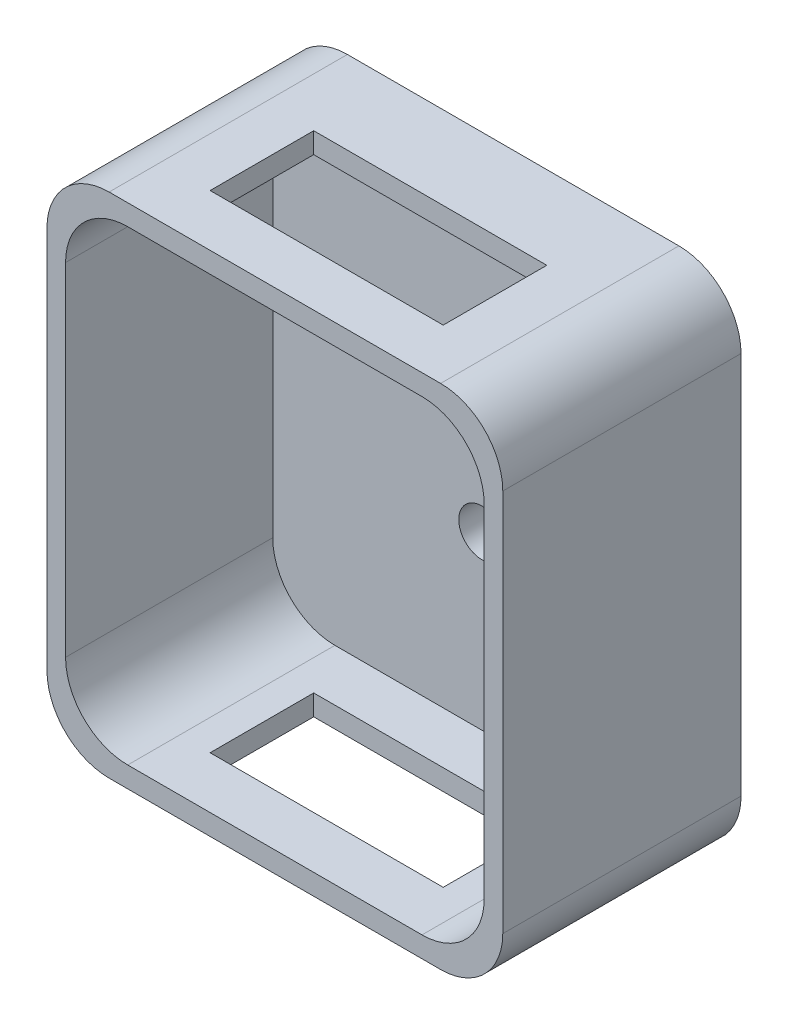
ISO-10303-21;
HEADER;
FILE_DESCRIPTION(('STEP AP214'),'2;1');
FILE_NAME('part.step','',(''),(''),'','','');
FILE_SCHEMA(('AUTOMOTIVE_DESIGN { 1 0 10303 214 1 1 1 1 }'));
ENDSEC;
DATA;
#1=APPLICATION_CONTEXT('core data for automotive mechanical design processes');
#2=APPLICATION_PROTOCOL_DEFINITION('international standard','automotive_design',2000,#1);
#3=PRODUCT_CONTEXT('',#1,'mechanical');
#4=PRODUCT('Part','Part','',(#3));
#5=PRODUCT_RELATED_PRODUCT_CATEGORY('part','',(#4));
#6=PRODUCT_DEFINITION_FORMATION('','',#4);
#7=PRODUCT_DEFINITION_CONTEXT('part definition',#1,'design');
#8=PRODUCT_DEFINITION('design','',#6,#7);
#9=PRODUCT_DEFINITION_SHAPE('','',#8);
#10=(LENGTH_UNIT() NAMED_UNIT(*) SI_UNIT(.MILLI.,.METRE.));
#11=(NAMED_UNIT(*) PLANE_ANGLE_UNIT() SI_UNIT($,.RADIAN.));
#12=(NAMED_UNIT(*) SI_UNIT($,.STERADIAN.) SOLID_ANGLE_UNIT());
#13=UNCERTAINTY_MEASURE_WITH_UNIT(LENGTH_MEASURE(1.E-05),#10,'distance_accuracy_value','');
#14=(GEOMETRIC_REPRESENTATION_CONTEXT(3) GLOBAL_UNCERTAINTY_ASSIGNED_CONTEXT((#13)) GLOBAL_UNIT_ASSIGNED_CONTEXT((#10,
#11,#12)) REPRESENTATION_CONTEXT('',''));
#15=CARTESIAN_POINT('',(0.,0.,0.));
#16=DIRECTION('',(0.,0.,1.));
#17=DIRECTION('',(1.,0.,0.));
#18=AXIS2_PLACEMENT_3D('',#15,#16,#17);
#19=CARTESIAN_POINT('',(-16.,-18.5000000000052,3.));
#20=DIRECTION('',(0.,0.,1.));
#21=DIRECTION('',(1.,0.,0.));
#22=AXIS2_PLACEMENT_3D('',#19,#20,#21);
#23=PLANE('',#22);
#24=CARTESIAN_POINT('',(-14.2040816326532,-16.5000000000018,3.));
#25=DIRECTION('',(0.,0.,1.));
#26=DIRECTION('',(1.,0.,0.));
#27=AXIS2_PLACEMENT_3D('',#24,#25,#26);
#28=CIRCLE('',#27,6.);
#29=CARTESIAN_POINT('',(-20.2040816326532,-16.5000000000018,3.));
#30=VERTEX_POINT('',#29);
#31=CARTESIAN_POINT('',(-14.2040816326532,-22.5000000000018,3.));
#32=VERTEX_POINT('',#31);
#33=EDGE_CURVE('E277',#30,#32,#28,.T.);
#34=ORIENTED_EDGE('',*,*,#33,.T.);
#35=DIRECTION('',(1.,0.,0.));
#36=VECTOR('',#35,1.);
#37=CARTESIAN_POINT('',(-14.2040816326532,-22.5000000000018,3.));
#38=LINE('',#37,#36);
#39=CARTESIAN_POINT('',(14.2040816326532,-22.5000000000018,3.));
#40=VERTEX_POINT('',#39);
#41=EDGE_CURVE('E307',#32,#40,#38,.T.);
#42=ORIENTED_EDGE('',*,*,#41,.T.);
#43=CARTESIAN_POINT('',(14.2040816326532,-16.5000000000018,3.));
#44=DIRECTION('',(0.,0.,1.));
#45=DIRECTION('',(1.,0.,0.));
#46=AXIS2_PLACEMENT_3D('',#43,#44,#45);
#47=CIRCLE('',#46,6.);
#48=CARTESIAN_POINT('',(20.2040816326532,-16.5000000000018,3.));
#49=VERTEX_POINT('',#48);
#50=EDGE_CURVE('E310',#40,#49,#47,.T.);
#51=ORIENTED_EDGE('',*,*,#50,.T.);
#52=DIRECTION('',(0.,1.,0.));
#53=VECTOR('',#52,1.);
#54=CARTESIAN_POINT('',(20.2040816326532,16.5000000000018,3.));
#55=LINE('',#54,#53);
#56=CARTESIAN_POINT('',(20.2040816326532,16.5000000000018,3.));
#57=VERTEX_POINT('',#56);
#58=EDGE_CURVE('E313',#49,#57,#55,.T.);
#59=ORIENTED_EDGE('',*,*,#58,.T.);
#60=CARTESIAN_POINT('',(14.2040816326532,16.5000000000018,3.));
#61=DIRECTION('',(0.,0.,1.));
#62=DIRECTION('',(1.,0.,0.));
#63=AXIS2_PLACEMENT_3D('',#60,#61,#62);
#64=CIRCLE('',#63,6.);
#65=CARTESIAN_POINT('',(14.2040816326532,22.5000000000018,3.));
#66=VERTEX_POINT('',#65);
#67=EDGE_CURVE('E316',#57,#66,#64,.T.);
#68=ORIENTED_EDGE('',*,*,#67,.T.);
#69=DIRECTION('',(-1.,0.,0.));
#70=VECTOR('',#69,1.);
#71=CARTESIAN_POINT('',(-14.2040816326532,22.5000000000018,3.));
#72=LINE('',#71,#70);
#73=CARTESIAN_POINT('',(-14.2040816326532,22.5000000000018,3.));
#74=VERTEX_POINT('',#73);
#75=EDGE_CURVE('E319',#66,#74,#72,.T.);
#76=ORIENTED_EDGE('',*,*,#75,.T.);
#77=CARTESIAN_POINT('',(-14.2040816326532,16.5000000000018,3.));
#78=DIRECTION('',(0.,0.,1.));
#79=DIRECTION('',(-1.,0.,0.));
#80=AXIS2_PLACEMENT_3D('',#77,#78,#79);
#81=CIRCLE('',#80,6.);
#82=CARTESIAN_POINT('',(-20.2040816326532,16.5000000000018,3.));
#83=VERTEX_POINT('',#82);
#84=EDGE_CURVE('E322',#74,#83,#81,.T.);
#85=ORIENTED_EDGE('',*,*,#84,.T.);
#86=DIRECTION('',(0.,-1.,0.));
#87=VECTOR('',#86,1.);
#88=CARTESIAN_POINT('',(-20.2040816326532,16.5000000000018,3.));
#89=LINE('',#88,#87);
#90=EDGE_CURVE('E282',#83,#30,#89,.T.);
#91=ORIENTED_EDGE('',*,*,#90,.T.);
#92=EDGE_LOOP('',(#34,#42,#51,#59,#68,#76,#85,#91));
#93=FACE_BOUND('',#92,.T.);
#94=CARTESIAN_POINT('',(0.,6.,3.));
#95=DIRECTION('',(0.,0.,1.));
#96=DIRECTION('',(1.,0.,0.));
#97=AXIS2_PLACEMENT_3D('',#94,#95,#96);
#98=CIRCLE('',#97,2.25);
#99=CARTESIAN_POINT('',(2.25,6.,3.));
#100=VERTEX_POINT('',#99);
#101=EDGE_CURVE('E399',#100,#100,#98,.T.);
#102=ORIENTED_EDGE('',*,*,#101,.F.);
#103=EDGE_LOOP('',(#102));
#104=FACE_BOUND('',#103,.T.);
#105=CARTESIAN_POINT('',(13.4,12.275,3.));
#106=DIRECTION('',(0.,0.,1.));
#107=DIRECTION('',(1.,0.,0.));
#108=AXIS2_PLACEMENT_3D('',#105,#106,#107);
#109=CIRCLE('',#108,1.5);
#110=CARTESIAN_POINT('',(14.9,12.275,3.));
#111=VERTEX_POINT('',#110);
#112=EDGE_CURVE('E415',#111,#111,#109,.T.);
#113=ORIENTED_EDGE('',*,*,#112,.F.);
#114=EDGE_LOOP('',(#113));
#115=FACE_BOUND('',#114,.T.);
#116=CARTESIAN_POINT('',(13.4,-8.225,3.));
#117=DIRECTION('',(0.,0.,1.));
#118=DIRECTION('',(1.,0.,0.));
#119=AXIS2_PLACEMENT_3D('',#116,#117,#118);
#120=CIRCLE('',#119,1.5);
#121=CARTESIAN_POINT('',(14.9,-8.225,3.));
#122=VERTEX_POINT('',#121);
#123=EDGE_CURVE('E407',#122,#122,#120,.T.);
#124=ORIENTED_EDGE('',*,*,#123,.F.);
#125=EDGE_LOOP('',(#124));
#126=FACE_BOUND('',#125,.T.);
#127=CARTESIAN_POINT('',(0.,-6.,3.));
#128=DIRECTION('',(0.,0.,1.));
#129=DIRECTION('',(1.,0.,0.));
#130=AXIS2_PLACEMENT_3D('',#127,#128,#129);
#131=CIRCLE('',#130,2.25);
#132=CARTESIAN_POINT('',(2.25,-6.,3.));
#133=VERTEX_POINT('',#132);
#134=EDGE_CURVE('E391',#133,#133,#131,.T.);
#135=ORIENTED_EDGE('',*,*,#134,.F.);
#136=EDGE_LOOP('',(#135));
#137=FACE_BOUND('',#136,.T.);
#138=ADVANCED_FACE('F45',(#93,#104,#115,#126,#137),#23,.T.);
#139=CARTESIAN_POINT('',(-16.,-18.5000000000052,0.));
#140=DIRECTION('',(0.,0.,1.));
#141=DIRECTION('',(1.,0.,0.));
#142=AXIS2_PLACEMENT_3D('',#139,#140,#141);
#143=PLANE('',#142);
#144=CARTESIAN_POINT('',(-16.,-18.5000000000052,0.));
#145=DIRECTION('',(0.,0.,1.));
#146=DIRECTION('',(1.,0.,0.));
#147=AXIS2_PLACEMENT_3D('',#144,#145,#146);
#148=CIRCLE('',#147,6.);
#149=CARTESIAN_POINT('',(-22.,-18.5000000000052,0.));
#150=VERTEX_POINT('',#149);
#151=CARTESIAN_POINT('',(-16.,-24.5000000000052,0.));
#152=VERTEX_POINT('',#151);
#153=EDGE_CURVE('E419',#150,#152,#148,.T.);
#154=ORIENTED_EDGE('',*,*,#153,.F.);
#155=DIRECTION('',(0.,-1.,0.));
#156=VECTOR('',#155,1.);
#157=CARTESIAN_POINT('',(-22.,-18.5000000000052,0.));
#158=LINE('',#157,#156);
#159=CARTESIAN_POINT('',(-22.,18.5000000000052,0.));
#160=VERTEX_POINT('',#159);
#161=EDGE_CURVE('E444',#160,#150,#158,.T.);
#162=ORIENTED_EDGE('',*,*,#161,.F.);
#163=CARTESIAN_POINT('',(-16.,18.5000000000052,0.));
#164=DIRECTION('',(0.,0.,1.));
#165=DIRECTION('',(1.,0.,0.));
#166=AXIS2_PLACEMENT_3D('',#163,#164,#165);
#167=CIRCLE('',#166,6.);
#168=CARTESIAN_POINT('',(-16.,24.5000000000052,0.));
#169=VERTEX_POINT('',#168);
#170=EDGE_CURVE('E441',#169,#160,#167,.T.);
#171=ORIENTED_EDGE('',*,*,#170,.F.);
#172=DIRECTION('',(-1.,0.,0.));
#173=VECTOR('',#172,1.);
#174=CARTESIAN_POINT('',(-16.,24.5000000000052,0.));
#175=LINE('',#174,#173);
#176=CARTESIAN_POINT('',(16.,24.5000000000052,0.));
#177=VERTEX_POINT('',#176);
#178=EDGE_CURVE('E438',#177,#169,#175,.T.);
#179=ORIENTED_EDGE('',*,*,#178,.F.);
#180=CARTESIAN_POINT('',(16.,18.5000000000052,0.));
#181=DIRECTION('',(0.,0.,1.));
#182=DIRECTION('',(1.,0.,0.));
#183=AXIS2_PLACEMENT_3D('',#180,#181,#182);
#184=CIRCLE('',#183,6.);
#185=CARTESIAN_POINT('',(22.,18.5000000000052,0.));
#186=VERTEX_POINT('',#185);
#187=EDGE_CURVE('E435',#186,#177,#184,.T.);
#188=ORIENTED_EDGE('',*,*,#187,.F.);
#189=DIRECTION('',(0.,1.,0.));
#190=VECTOR('',#189,1.);
#191=CARTESIAN_POINT('',(22.,-18.5000000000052,0.));
#192=LINE('',#191,#190);
#193=CARTESIAN_POINT('',(22.,-18.5000000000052,0.));
#194=VERTEX_POINT('',#193);
#195=EDGE_CURVE('E432',#194,#186,#192,.T.);
#196=ORIENTED_EDGE('',*,*,#195,.F.);
#197=CARTESIAN_POINT('',(16.,-18.5000000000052,0.));
#198=DIRECTION('',(0.,0.,1.));
#199=DIRECTION('',(1.,0.,0.));
#200=AXIS2_PLACEMENT_3D('',#197,#198,#199);
#201=CIRCLE('',#200,6.);
#202=CARTESIAN_POINT('',(16.,-24.5000000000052,0.));
#203=VERTEX_POINT('',#202);
#204=EDGE_CURVE('E429',#203,#194,#201,.T.);
#205=ORIENTED_EDGE('',*,*,#204,.F.);
#206=DIRECTION('',(1.,0.,0.));
#207=VECTOR('',#206,1.);
#208=CARTESIAN_POINT('',(-16.,-24.5000000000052,0.));
#209=LINE('',#208,#207);
#210=EDGE_CURVE('E426',#152,#203,#209,.T.);
#211=ORIENTED_EDGE('',*,*,#210,.F.);
#212=EDGE_LOOP('',(#154,#162,#171,#179,#188,#196,#205,#211));
#213=FACE_BOUND('',#212,.T.);
#214=CARTESIAN_POINT('',(13.4,12.275,0.));
#215=DIRECTION('',(0.,0.,1.));
#216=DIRECTION('',(1.,0.,0.));
#217=AXIS2_PLACEMENT_3D('',#214,#215,#216);
#218=CIRCLE('',#217,1.5);
#219=CARTESIAN_POINT('',(14.9,12.275,0.));
#220=VERTEX_POINT('',#219);
#221=EDGE_CURVE('E411',#220,#220,#218,.T.);
#222=ORIENTED_EDGE('',*,*,#221,.T.);
#223=EDGE_LOOP('',(#222));
#224=FACE_BOUND('',#223,.T.);
#225=CARTESIAN_POINT('',(13.4,-8.225,0.));
#226=DIRECTION('',(0.,0.,1.));
#227=DIRECTION('',(1.,0.,0.));
#228=AXIS2_PLACEMENT_3D('',#225,#226,#227);
#229=CIRCLE('',#228,1.5);
#230=CARTESIAN_POINT('',(14.9,-8.225,0.));
#231=VERTEX_POINT('',#230);
#232=EDGE_CURVE('E403',#231,#231,#229,.T.);
#233=ORIENTED_EDGE('',*,*,#232,.T.);
#234=EDGE_LOOP('',(#233));
#235=FACE_BOUND('',#234,.T.);
#236=CARTESIAN_POINT('',(0.,6.,0.));
#237=DIRECTION('',(0.,0.,1.));
#238=DIRECTION('',(1.,0.,0.));
#239=AXIS2_PLACEMENT_3D('',#236,#237,#238);
#240=CIRCLE('',#239,2.25);
#241=CARTESIAN_POINT('',(2.25,6.,0.));
#242=VERTEX_POINT('',#241);
#243=EDGE_CURVE('E395',#242,#242,#240,.T.);
#244=ORIENTED_EDGE('',*,*,#243,.T.);
#245=EDGE_LOOP('',(#244));
#246=FACE_BOUND('',#245,.T.);
#247=CARTESIAN_POINT('',(0.,-6.,0.));
#248=DIRECTION('',(0.,0.,1.));
#249=DIRECTION('',(1.,0.,0.));
#250=AXIS2_PLACEMENT_3D('',#247,#248,#249);
#251=CIRCLE('',#250,2.25);
#252=CARTESIAN_POINT('',(2.25,-6.,0.));
#253=VERTEX_POINT('',#252);
#254=EDGE_CURVE('E390',#253,#253,#251,.T.);
#255=ORIENTED_EDGE('',*,*,#254,.T.);
#256=EDGE_LOOP('',(#255));
#257=FACE_BOUND('',#256,.T.);
#258=ADVANCED_FACE('F507',(#213,#224,#235,#246,#257),#143,.F.);
#259=CARTESIAN_POINT('',(-16.,-18.5000000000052,3.));
#260=DIRECTION('',(0.,0.,-1.));
#261=DIRECTION('',(-1.,0.,0.));
#262=AXIS2_PLACEMENT_3D('',#259,#260,#261);
#263=CYLINDRICAL_SURFACE('',#262,6.);
#264=ORIENTED_EDGE('',*,*,#153,.T.);
#265=DIRECTION('',(0.,0.,-1.));
#266=VECTOR('',#265,1.);
#267=CARTESIAN_POINT('',(-16.,-24.5000000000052,3.));
#268=LINE('',#267,#266);
#269=CARTESIAN_POINT('',(-16.,-24.5000000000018,23.));
#270=VERTEX_POINT('',#269);
#271=EDGE_CURVE('E475',#270,#152,#268,.T.);
#272=ORIENTED_EDGE('',*,*,#271,.F.);
#273=CARTESIAN_POINT('',(-16.,-18.5000000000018,23.));
#274=DIRECTION('',(0.,0.,1.));
#275=DIRECTION('',(1.,0.,0.));
#276=AXIS2_PLACEMENT_3D('',#273,#274,#275);
#277=CIRCLE('',#276,6.);
#278=CARTESIAN_POINT('',(-22.,-18.5000000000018,23.));
#279=VERTEX_POINT('',#278);
#280=EDGE_CURVE('E358',#279,#270,#277,.T.);
#281=ORIENTED_EDGE('',*,*,#280,.F.);
#282=DIRECTION('',(0.,0.,-1.));
#283=VECTOR('',#282,1.);
#284=CARTESIAN_POINT('',(-22.,-18.5000000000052,3.));
#285=LINE('',#284,#283);
#286=EDGE_CURVE('E447',#279,#150,#285,.T.);
#287=ORIENTED_EDGE('',*,*,#286,.T.);
#288=EDGE_LOOP('',(#264,#272,#281,#287));
#289=FACE_BOUND('',#288,.T.);
#290=ADVANCED_FACE('F47',(#289),#263,.T.);
#291=CARTESIAN_POINT('',(-16.,-24.5000000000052,3.));
#292=DIRECTION('',(0.,1.,0.));
#293=DIRECTION('',(0.,0.,1.));
#294=AXIS2_PLACEMENT_3D('',#291,#292,#293);
#295=PLANE('',#294);
#296=DIRECTION('',(1.,0.,0.));
#297=VECTOR('',#296,1.);
#298=CARTESIAN_POINT('',(-16.,-24.5000000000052,18.));
#299=LINE('',#298,#297);
#300=CARTESIAN_POINT('',(-11.25,-24.5000000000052,18.));
#301=VERTEX_POINT('',#300);
#302=CARTESIAN_POINT('',(11.25,-24.5000000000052,18.));
#303=VERTEX_POINT('',#302);
#304=EDGE_CURVE('E265',#301,#303,#299,.T.);
#305=ORIENTED_EDGE('',*,*,#304,.T.);
#306=DIRECTION('',(0.,0.,-1.));
#307=VECTOR('',#306,1.);
#308=CARTESIAN_POINT('',(11.25,-24.5000000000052,3.));
#309=LINE('',#308,#307);
#310=CARTESIAN_POINT('',(11.25,-24.5000000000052,8.));
#311=VERTEX_POINT('',#310);
#312=EDGE_CURVE('E273',#303,#311,#309,.T.);
#313=ORIENTED_EDGE('',*,*,#312,.T.);
#314=DIRECTION('',(-1.,0.,0.));
#315=VECTOR('',#314,1.);
#316=CARTESIAN_POINT('',(-16.,-24.5000000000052,8.));
#317=LINE('',#316,#315);
#318=CARTESIAN_POINT('',(-11.25,-24.5000000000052,8.));
#319=VERTEX_POINT('',#318);
#320=EDGE_CURVE('E251',#311,#319,#317,.T.);
#321=ORIENTED_EDGE('',*,*,#320,.T.);
#322=DIRECTION('',(0.,0.,1.));
#323=VECTOR('',#322,1.);
#324=CARTESIAN_POINT('',(-11.25,-24.5000000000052,3.));
#325=LINE('',#324,#323);
#326=EDGE_CURVE('E258',#319,#301,#325,.T.);
#327=ORIENTED_EDGE('',*,*,#326,.T.);
#328=EDGE_LOOP('',(#305,#313,#321,#327));
#329=FACE_BOUND('',#328,.T.);
#330=ORIENTED_EDGE('',*,*,#210,.T.);
#331=DIRECTION('',(0.,0.,-1.));
#332=VECTOR('',#331,1.);
#333=CARTESIAN_POINT('',(16.,-24.5000000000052,3.));
#334=LINE('',#333,#332);
#335=CARTESIAN_POINT('',(16.,-24.5000000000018,23.));
#336=VERTEX_POINT('',#335);
#337=EDGE_CURVE('E471',#336,#203,#334,.T.);
#338=ORIENTED_EDGE('',*,*,#337,.F.);
#339=DIRECTION('',(1.,0.,0.));
#340=VECTOR('',#339,1.);
#341=CARTESIAN_POINT('',(-16.,-24.5000000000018,23.));
#342=LINE('',#341,#340);
#343=EDGE_CURVE('E362',#270,#336,#342,.T.);
#344=ORIENTED_EDGE('',*,*,#343,.F.);
#345=ORIENTED_EDGE('',*,*,#271,.T.);
#346=EDGE_LOOP('',(#330,#338,#344,#345));
#347=FACE_BOUND('',#346,.T.);
#348=ADVANCED_FACE('F542',(#329,#347),#295,.F.);
#349=CARTESIAN_POINT('',(16.,-18.5000000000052,3.));
#350=DIRECTION('',(0.,0.,-1.));
#351=DIRECTION('',(-1.,0.,0.));
#352=AXIS2_PLACEMENT_3D('',#349,#350,#351);
#353=CYLINDRICAL_SURFACE('',#352,6.);
#354=ORIENTED_EDGE('',*,*,#204,.T.);
#355=DIRECTION('',(0.,0.,-1.));
#356=VECTOR('',#355,1.);
#357=CARTESIAN_POINT('',(22.,-18.5000000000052,3.));
#358=LINE('',#357,#356);
#359=CARTESIAN_POINT('',(22.,-18.5000000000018,23.));
#360=VERTEX_POINT('',#359);
#361=EDGE_CURVE('E467',#360,#194,#358,.T.);
#362=ORIENTED_EDGE('',*,*,#361,.F.);
#363=CARTESIAN_POINT('',(16.,-18.5000000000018,23.));
#364=DIRECTION('',(0.,0.,1.));
#365=DIRECTION('',(1.,0.,0.));
#366=AXIS2_PLACEMENT_3D('',#363,#364,#365);
#367=CIRCLE('',#366,6.);
#368=EDGE_CURVE('E366',#336,#360,#367,.T.);
#369=ORIENTED_EDGE('',*,*,#368,.F.);
#370=ORIENTED_EDGE('',*,*,#337,.T.);
#371=EDGE_LOOP('',(#354,#362,#369,#370));
#372=FACE_BOUND('',#371,.T.);
#373=ADVANCED_FACE('F539',(#372),#353,.T.);
#374=CARTESIAN_POINT('',(22.,-18.5000000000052,3.));
#375=DIRECTION('',(-1.,0.,0.));
#376=DIRECTION('',(0.,0.,1.));
#377=AXIS2_PLACEMENT_3D('',#374,#375,#376);
#378=PLANE('',#377);
#379=ORIENTED_EDGE('',*,*,#195,.T.);
#380=DIRECTION('',(0.,0.,-1.));
#381=VECTOR('',#380,1.);
#382=CARTESIAN_POINT('',(22.,18.5000000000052,3.));
#383=LINE('',#382,#381);
#384=CARTESIAN_POINT('',(22.,18.5000000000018,23.));
#385=VERTEX_POINT('',#384);
#386=EDGE_CURVE('E463',#385,#186,#383,.T.);
#387=ORIENTED_EDGE('',*,*,#386,.F.);
#388=DIRECTION('',(0.,1.,0.));
#389=VECTOR('',#388,1.);
#390=CARTESIAN_POINT('',(22.,-18.5000000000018,23.));
#391=LINE('',#390,#389);
#392=EDGE_CURVE('E370',#360,#385,#391,.T.);
#393=ORIENTED_EDGE('',*,*,#392,.F.);
#394=ORIENTED_EDGE('',*,*,#361,.T.);
#395=EDGE_LOOP('',(#379,#387,#393,#394));
#396=FACE_BOUND('',#395,.T.);
#397=ADVANCED_FACE('F535',(#396),#378,.F.);
#398=CARTESIAN_POINT('',(16.,18.5000000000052,3.));
#399=DIRECTION('',(0.,0.,-1.));
#400=DIRECTION('',(-1.,0.,0.));
#401=AXIS2_PLACEMENT_3D('',#398,#399,#400);
#402=CYLINDRICAL_SURFACE('',#401,6.);
#403=ORIENTED_EDGE('',*,*,#187,.T.);
#404=DIRECTION('',(0.,0.,-1.));
#405=VECTOR('',#404,1.);
#406=CARTESIAN_POINT('',(16.,24.5000000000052,3.));
#407=LINE('',#406,#405);
#408=CARTESIAN_POINT('',(16.,24.5000000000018,23.));
#409=VERTEX_POINT('',#408);
#410=EDGE_CURVE('E459',#409,#177,#407,.T.);
#411=ORIENTED_EDGE('',*,*,#410,.F.);
#412=CARTESIAN_POINT('',(16.,18.5000000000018,23.));
#413=DIRECTION('',(0.,0.,1.));
#414=DIRECTION('',(1.,0.,0.));
#415=AXIS2_PLACEMENT_3D('',#412,#413,#414);
#416=CIRCLE('',#415,6.);
#417=EDGE_CURVE('E374',#385,#409,#416,.T.);
#418=ORIENTED_EDGE('',*,*,#417,.F.);
#419=ORIENTED_EDGE('',*,*,#386,.T.);
#420=EDGE_LOOP('',(#403,#411,#418,#419));
#421=FACE_BOUND('',#420,.T.);
#422=ADVANCED_FACE('F532',(#421),#402,.T.);
#423=CARTESIAN_POINT('',(-16.,24.5000000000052,3.));
#424=DIRECTION('',(0.,-1.,0.));
#425=DIRECTION('',(1.,0.,0.));
#426=AXIS2_PLACEMENT_3D('',#423,#424,#425);
#427=PLANE('',#426);
#428=DIRECTION('',(-1.,0.,0.));
#429=VECTOR('',#428,1.);
#430=CARTESIAN_POINT('',(-11.25,24.5000000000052,8.));
#431=LINE('',#430,#429);
#432=CARTESIAN_POINT('',(11.25,24.5000000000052,8.));
#433=VERTEX_POINT('',#432);
#434=CARTESIAN_POINT('',(-11.25,24.5000000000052,8.));
#435=VERTEX_POINT('',#434);
#436=EDGE_CURVE('E222',#433,#435,#431,.T.);
#437=ORIENTED_EDGE('',*,*,#436,.F.);
#438=DIRECTION('',(0.,0.,-1.));
#439=VECTOR('',#438,1.);
#440=CARTESIAN_POINT('',(11.25,24.5000000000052,8.));
#441=LINE('',#440,#439);
#442=CARTESIAN_POINT('',(11.25,24.5000000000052,18.));
#443=VERTEX_POINT('',#442);
#444=EDGE_CURVE('E69',#443,#433,#441,.T.);
#445=ORIENTED_EDGE('',*,*,#444,.F.);
#446=DIRECTION('',(1.,0.,0.));
#447=VECTOR('',#446,1.);
#448=CARTESIAN_POINT('',(-11.25,24.5000000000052,18.));
#449=LINE('',#448,#447);
#450=CARTESIAN_POINT('',(-11.25,24.5000000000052,18.));
#451=VERTEX_POINT('',#450);
#452=EDGE_CURVE('E231',#451,#443,#449,.T.);
#453=ORIENTED_EDGE('',*,*,#452,.F.);
#454=DIRECTION('',(0.,0.,1.));
#455=VECTOR('',#454,1.);
#456=CARTESIAN_POINT('',(-11.25,24.5000000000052,8.));
#457=LINE('',#456,#455);
#458=EDGE_CURVE('E212',#435,#451,#457,.T.);
#459=ORIENTED_EDGE('',*,*,#458,.F.);
#460=EDGE_LOOP('',(#437,#445,#453,#459));
#461=FACE_BOUND('',#460,.T.);
#462=ORIENTED_EDGE('',*,*,#178,.T.);
#463=DIRECTION('',(0.,0.,-1.));
#464=VECTOR('',#463,1.);
#465=CARTESIAN_POINT('',(-16.,24.5000000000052,3.));
#466=LINE('',#465,#464);
#467=CARTESIAN_POINT('',(-16.,24.5000000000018,23.));
#468=VERTEX_POINT('',#467);
#469=EDGE_CURVE('E455',#468,#169,#466,.T.);
#470=ORIENTED_EDGE('',*,*,#469,.F.);
#471=DIRECTION('',(-1.,0.,0.));
#472=VECTOR('',#471,1.);
#473=CARTESIAN_POINT('',(-16.,24.5000000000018,23.));
#474=LINE('',#473,#472);
#475=EDGE_CURVE('E378',#409,#468,#474,.T.);
#476=ORIENTED_EDGE('',*,*,#475,.F.);
#477=ORIENTED_EDGE('',*,*,#410,.T.);
#478=EDGE_LOOP('',(#462,#470,#476,#477));
#479=FACE_BOUND('',#478,.T.);
#480=ADVANCED_FACE('F228',(#461,#479),#427,.F.);
#481=CARTESIAN_POINT('',(-16.,18.5000000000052,3.));
#482=DIRECTION('',(0.,0.,-1.));
#483=DIRECTION('',(-1.,0.,0.));
#484=AXIS2_PLACEMENT_3D('',#481,#482,#483);
#485=CYLINDRICAL_SURFACE('',#484,6.);
#486=ORIENTED_EDGE('',*,*,#170,.T.);
#487=DIRECTION('',(0.,0.,-1.));
#488=VECTOR('',#487,1.);
#489=CARTESIAN_POINT('',(-22.,18.5000000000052,3.));
#490=LINE('',#489,#488);
#491=CARTESIAN_POINT('',(-22.,18.5000000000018,23.));
#492=VERTEX_POINT('',#491);
#493=EDGE_CURVE('E451',#492,#160,#490,.T.);
#494=ORIENTED_EDGE('',*,*,#493,.F.);
#495=CARTESIAN_POINT('',(-16.,18.5000000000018,23.));
#496=DIRECTION('',(0.,0.,1.));
#497=DIRECTION('',(1.,0.,0.));
#498=AXIS2_PLACEMENT_3D('',#495,#496,#497);
#499=CIRCLE('',#498,6.);
#500=EDGE_CURVE('E382',#468,#492,#499,.T.);
#501=ORIENTED_EDGE('',*,*,#500,.F.);
#502=ORIENTED_EDGE('',*,*,#469,.T.);
#503=EDGE_LOOP('',(#486,#494,#501,#502));
#504=FACE_BOUND('',#503,.T.);
#505=ADVANCED_FACE('F525',(#504),#485,.T.);
#506=CARTESIAN_POINT('',(-22.,-18.5000000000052,3.));
#507=DIRECTION('',(1.,0.,0.));
#508=DIRECTION('',(0.,0.,-1.));
#509=AXIS2_PLACEMENT_3D('',#506,#507,#508);
#510=PLANE('',#509);
#511=ORIENTED_EDGE('',*,*,#161,.T.);
#512=ORIENTED_EDGE('',*,*,#286,.F.);
#513=DIRECTION('',(0.,-1.,0.));
#514=VECTOR('',#513,1.);
#515=CARTESIAN_POINT('',(-22.,-18.5000000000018,23.));
#516=LINE('',#515,#514);
#517=EDGE_CURVE('E386',#492,#279,#516,.T.);
#518=ORIENTED_EDGE('',*,*,#517,.F.);
#519=ORIENTED_EDGE('',*,*,#493,.T.);
#520=EDGE_LOOP('',(#511,#512,#518,#519));
#521=FACE_BOUND('',#520,.T.);
#522=ADVANCED_FACE('F522',(#521),#510,.F.);
#523=CARTESIAN_POINT('',(13.4,12.275,3.));
#524=DIRECTION('',(0.,0.,-1.));
#525=DIRECTION('',(-1.,0.,0.));
#526=AXIS2_PLACEMENT_3D('',#523,#524,#525);
#527=CYLINDRICAL_SURFACE('',#526,1.5);
#528=ORIENTED_EDGE('',*,*,#112,.T.);
#529=EDGE_LOOP('',(#528));
#530=FACE_BOUND('',#529,.T.);
#531=ORIENTED_EDGE('',*,*,#221,.F.);
#532=EDGE_LOOP('',(#531));
#533=FACE_BOUND('',#532,.T.);
#534=ADVANCED_FACE('F519',(#530,#533),#527,.F.);
#535=CARTESIAN_POINT('',(13.4,-8.225,3.));
#536=DIRECTION('',(0.,0.,-1.));
#537=DIRECTION('',(-1.,0.,0.));
#538=AXIS2_PLACEMENT_3D('',#535,#536,#537);
#539=CYLINDRICAL_SURFACE('',#538,1.5);
#540=ORIENTED_EDGE('',*,*,#123,.T.);
#541=EDGE_LOOP('',(#540));
#542=FACE_BOUND('',#541,.T.);
#543=ORIENTED_EDGE('',*,*,#232,.F.);
#544=EDGE_LOOP('',(#543));
#545=FACE_BOUND('',#544,.T.);
#546=ADVANCED_FACE('F629',(#542,#545),#539,.F.);
#547=CARTESIAN_POINT('',(0.,6.,3.));
#548=DIRECTION('',(0.,0.,-1.));
#549=DIRECTION('',(-1.,0.,0.));
#550=AXIS2_PLACEMENT_3D('',#547,#548,#549);
#551=CYLINDRICAL_SURFACE('',#550,2.25);
#552=ORIENTED_EDGE('',*,*,#101,.T.);
#553=EDGE_LOOP('',(#552));
#554=FACE_BOUND('',#553,.T.);
#555=ORIENTED_EDGE('',*,*,#243,.F.);
#556=EDGE_LOOP('',(#555));
#557=FACE_BOUND('',#556,.T.);
#558=ADVANCED_FACE('F626',(#554,#557),#551,.F.);
#559=CARTESIAN_POINT('',(0.,-6.,3.));
#560=DIRECTION('',(0.,0.,-1.));
#561=DIRECTION('',(-1.,0.,0.));
#562=AXIS2_PLACEMENT_3D('',#559,#560,#561);
#563=CYLINDRICAL_SURFACE('',#562,2.25);
#564=ORIENTED_EDGE('',*,*,#134,.T.);
#565=EDGE_LOOP('',(#564));
#566=FACE_BOUND('',#565,.T.);
#567=ORIENTED_EDGE('',*,*,#254,.F.);
#568=EDGE_LOOP('',(#567));
#569=FACE_BOUND('',#568,.T.);
#570=ADVANCED_FACE('F572',(#566,#569),#563,.F.);
#571=CARTESIAN_POINT('',(-16.,-18.5000000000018,23.));
#572=DIRECTION('',(0.,0.,1.));
#573=DIRECTION('',(1.,0.,0.));
#574=AXIS2_PLACEMENT_3D('',#571,#572,#573);
#575=PLANE('',#574);
#576=ORIENTED_EDGE('',*,*,#280,.T.);
#577=ORIENTED_EDGE('',*,*,#343,.T.);
#578=ORIENTED_EDGE('',*,*,#368,.T.);
#579=ORIENTED_EDGE('',*,*,#392,.T.);
#580=ORIENTED_EDGE('',*,*,#417,.T.);
#581=ORIENTED_EDGE('',*,*,#475,.T.);
#582=ORIENTED_EDGE('',*,*,#500,.T.);
#583=ORIENTED_EDGE('',*,*,#517,.T.);
#584=EDGE_LOOP('',(#576,#577,#578,#579,#580,#581,#582,#583));
#585=FACE_BOUND('',#584,.T.);
#586=DIRECTION('',(1.,0.,0.));
#587=VECTOR('',#586,1.);
#588=CARTESIAN_POINT('',(-14.2040816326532,-22.5000000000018,23.));
#589=LINE('',#588,#587);
#590=CARTESIAN_POINT('',(-14.2040816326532,-22.5000000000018,23.));
#591=VERTEX_POINT('',#590);
#592=CARTESIAN_POINT('',(14.2040816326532,-22.5000000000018,23.));
#593=VERTEX_POINT('',#592);
#594=EDGE_CURVE('E281',#591,#593,#589,.T.);
#595=ORIENTED_EDGE('',*,*,#594,.F.);
#596=CARTESIAN_POINT('',(-14.2040816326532,-16.5000000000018,23.));
#597=DIRECTION('',(0.,0.,1.));
#598=DIRECTION('',(1.,0.,0.));
#599=AXIS2_PLACEMENT_3D('',#596,#597,#598);
#600=CIRCLE('',#599,6.);
#601=CARTESIAN_POINT('',(-20.2040816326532,-16.5000000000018,23.));
#602=VERTEX_POINT('',#601);
#603=EDGE_CURVE('E278',#602,#591,#600,.T.);
#604=ORIENTED_EDGE('',*,*,#603,.F.);
#605=DIRECTION('',(0.,-1.,0.));
#606=VECTOR('',#605,1.);
#607=CARTESIAN_POINT('',(-20.2040816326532,16.5000000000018,23.));
#608=LINE('',#607,#606);
#609=CARTESIAN_POINT('',(-20.2040816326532,16.5000000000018,23.));
#610=VERTEX_POINT('',#609);
#611=EDGE_CURVE('E301',#610,#602,#608,.T.);
#612=ORIENTED_EDGE('',*,*,#611,.F.);
#613=CARTESIAN_POINT('',(-14.2040816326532,16.5000000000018,23.));
#614=DIRECTION('',(0.,0.,1.));
#615=DIRECTION('',(-1.,0.,0.));
#616=AXIS2_PLACEMENT_3D('',#613,#614,#615);
#617=CIRCLE('',#616,6.);
#618=CARTESIAN_POINT('',(-14.2040816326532,22.5000000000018,23.));
#619=VERTEX_POINT('',#618);
#620=EDGE_CURVE('E297',#619,#610,#617,.T.);
#621=ORIENTED_EDGE('',*,*,#620,.F.);
#622=DIRECTION('',(-1.,0.,0.));
#623=VECTOR('',#622,1.);
#624=CARTESIAN_POINT('',(-14.2040816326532,22.5000000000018,23.));
#625=LINE('',#624,#623);
#626=CARTESIAN_POINT('',(14.2040816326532,22.5000000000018,23.));
#627=VERTEX_POINT('',#626);
#628=EDGE_CURVE('E294',#627,#619,#625,.T.);
#629=ORIENTED_EDGE('',*,*,#628,.F.);
#630=CARTESIAN_POINT('',(14.2040816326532,16.5000000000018,23.));
#631=DIRECTION('',(0.,0.,1.));
#632=DIRECTION('',(1.,0.,0.));
#633=AXIS2_PLACEMENT_3D('',#630,#631,#632);
#634=CIRCLE('',#633,6.);
#635=CARTESIAN_POINT('',(20.2040816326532,16.5000000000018,23.));
#636=VERTEX_POINT('',#635);
#637=EDGE_CURVE('E291',#636,#627,#634,.T.);
#638=ORIENTED_EDGE('',*,*,#637,.F.);
#639=DIRECTION('',(0.,1.,0.));
#640=VECTOR('',#639,1.);
#641=CARTESIAN_POINT('',(20.2040816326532,16.5000000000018,23.));
#642=LINE('',#641,#640);
#643=CARTESIAN_POINT('',(20.2040816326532,-16.5000000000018,23.));
#644=VERTEX_POINT('',#643);
#645=EDGE_CURVE('E288',#644,#636,#642,.T.);
#646=ORIENTED_EDGE('',*,*,#645,.F.);
#647=CARTESIAN_POINT('',(14.2040816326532,-16.5000000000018,23.));
#648=DIRECTION('',(0.,0.,1.));
#649=DIRECTION('',(1.,0.,0.));
#650=AXIS2_PLACEMENT_3D('',#647,#648,#649);
#651=CIRCLE('',#650,6.);
#652=EDGE_CURVE('E285',#593,#644,#651,.T.);
#653=ORIENTED_EDGE('',*,*,#652,.F.);
#654=EDGE_LOOP('',(#595,#604,#612,#621,#629,#638,#646,#653));
#655=FACE_BOUND('',#654,.T.);
#656=ADVANCED_FACE('F563',(#585,#655),#575,.T.);
#657=CARTESIAN_POINT('',(-14.2040816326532,-16.5000000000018,23.));
#658=DIRECTION('',(0.,0.,-1.));
#659=DIRECTION('',(-1.,0.,0.));
#660=AXIS2_PLACEMENT_3D('',#657,#658,#659);
#661=CYLINDRICAL_SURFACE('',#660,6.);
#662=ORIENTED_EDGE('',*,*,#33,.F.);
#663=DIRECTION('',(0.,0.,-1.));
#664=VECTOR('',#663,1.);
#665=CARTESIAN_POINT('',(-20.2040816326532,-16.5000000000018,23.));
#666=LINE('',#665,#664);
#667=EDGE_CURVE('E304',#602,#30,#666,.T.);
#668=ORIENTED_EDGE('',*,*,#667,.F.);
#669=ORIENTED_EDGE('',*,*,#603,.T.);
#670=DIRECTION('',(0.,0.,-1.));
#671=VECTOR('',#670,1.);
#672=CARTESIAN_POINT('',(-14.2040816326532,-22.5000000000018,23.));
#673=LINE('',#672,#671);
#674=EDGE_CURVE('E354',#591,#32,#673,.T.);
#675=ORIENTED_EDGE('',*,*,#674,.T.);
#676=EDGE_LOOP('',(#662,#668,#669,#675));
#677=FACE_BOUND('',#676,.T.);
#678=ADVANCED_FACE('F571',(#677),#661,.F.);
#679=CARTESIAN_POINT('',(-14.2040816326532,-22.5000000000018,23.));
#680=DIRECTION('',(0.,1.,0.));
#681=DIRECTION('',(0.,0.,1.));
#682=AXIS2_PLACEMENT_3D('',#679,#680,#681);
#683=PLANE('',#682);
#684=DIRECTION('',(0.,0.,-1.));
#685=VECTOR('',#684,1.);
#686=CARTESIAN_POINT('',(11.25,-22.5000000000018,23.));
#687=LINE('',#686,#685);
#688=CARTESIAN_POINT('',(11.25,-22.5000000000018,18.));
#689=VERTEX_POINT('',#688);
#690=CARTESIAN_POINT('',(11.25,-22.5000000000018,8.));
#691=VERTEX_POINT('',#690);
#692=EDGE_CURVE('E269',#689,#691,#687,.T.);
#693=ORIENTED_EDGE('',*,*,#692,.F.);
#694=DIRECTION('',(1.,0.,0.));
#695=VECTOR('',#694,1.);
#696=CARTESIAN_POINT('',(-14.2040816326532,-22.5000000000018,18.));
#697=LINE('',#696,#695);
#698=CARTESIAN_POINT('',(-11.25,-22.5000000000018,18.));
#699=VERTEX_POINT('',#698);
#700=EDGE_CURVE('E262',#699,#689,#697,.T.);
#701=ORIENTED_EDGE('',*,*,#700,.F.);
#702=DIRECTION('',(0.,0.,1.));
#703=VECTOR('',#702,1.);
#704=CARTESIAN_POINT('',(-11.25,-22.5000000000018,23.));
#705=LINE('',#704,#703);
#706=CARTESIAN_POINT('',(-11.25,-22.5000000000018,8.));
#707=VERTEX_POINT('',#706);
#708=EDGE_CURVE('E255',#707,#699,#705,.T.);
#709=ORIENTED_EDGE('',*,*,#708,.F.);
#710=DIRECTION('',(-1.,0.,0.));
#711=VECTOR('',#710,1.);
#712=CARTESIAN_POINT('',(-14.2040816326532,-22.5000000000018,8.));
#713=LINE('',#712,#711);
#714=EDGE_CURVE('E248',#691,#707,#713,.T.);
#715=ORIENTED_EDGE('',*,*,#714,.F.);
#716=EDGE_LOOP('',(#693,#701,#709,#715));
#717=FACE_BOUND('',#716,.T.);
#718=ORIENTED_EDGE('',*,*,#41,.F.);
#719=ORIENTED_EDGE('',*,*,#674,.F.);
#720=ORIENTED_EDGE('',*,*,#594,.T.);
#721=DIRECTION('',(0.,0.,-1.));
#722=VECTOR('',#721,1.);
#723=CARTESIAN_POINT('',(14.2040816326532,-22.5000000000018,23.));
#724=LINE('',#723,#722);
#725=EDGE_CURVE('E350',#593,#40,#724,.T.);
#726=ORIENTED_EDGE('',*,*,#725,.T.);
#727=EDGE_LOOP('',(#718,#719,#720,#726));
#728=FACE_BOUND('',#727,.T.);
#729=ADVANCED_FACE('F583',(#717,#728),#683,.T.);
#730=CARTESIAN_POINT('',(14.2040816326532,-16.5000000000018,23.));
#731=DIRECTION('',(0.,0.,-1.));
#732=DIRECTION('',(-1.,0.,0.));
#733=AXIS2_PLACEMENT_3D('',#730,#731,#732);
#734=CYLINDRICAL_SURFACE('',#733,6.);
#735=ORIENTED_EDGE('',*,*,#50,.F.);
#736=ORIENTED_EDGE('',*,*,#725,.F.);
#737=ORIENTED_EDGE('',*,*,#652,.T.);
#738=DIRECTION('',(0.,0.,-1.));
#739=VECTOR('',#738,1.);
#740=CARTESIAN_POINT('',(20.2040816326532,-16.5000000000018,23.));
#741=LINE('',#740,#739);
#742=EDGE_CURVE('E346',#644,#49,#741,.T.);
#743=ORIENTED_EDGE('',*,*,#742,.T.);
#744=EDGE_LOOP('',(#735,#736,#737,#743));
#745=FACE_BOUND('',#744,.T.);
#746=ADVANCED_FACE('F586',(#745),#734,.F.);
#747=CARTESIAN_POINT('',(20.2040816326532,16.5000000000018,23.));
#748=DIRECTION('',(-1.,0.,0.));
#749=DIRECTION('',(0.,0.,1.));
#750=AXIS2_PLACEMENT_3D('',#747,#748,#749);
#751=PLANE('',#750);
#752=ORIENTED_EDGE('',*,*,#58,.F.);
#753=ORIENTED_EDGE('',*,*,#742,.F.);
#754=ORIENTED_EDGE('',*,*,#645,.T.);
#755=DIRECTION('',(0.,0.,-1.));
#756=VECTOR('',#755,1.);
#757=CARTESIAN_POINT('',(20.2040816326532,16.5000000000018,23.));
#758=LINE('',#757,#756);
#759=EDGE_CURVE('E342',#636,#57,#758,.T.);
#760=ORIENTED_EDGE('',*,*,#759,.T.);
#761=EDGE_LOOP('',(#752,#753,#754,#760));
#762=FACE_BOUND('',#761,.T.);
#763=ADVANCED_FACE('F609',(#762),#751,.T.);
#764=CARTESIAN_POINT('',(14.2040816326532,16.5000000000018,23.));
#765=DIRECTION('',(0.,0.,-1.));
#766=DIRECTION('',(-1.,0.,0.));
#767=AXIS2_PLACEMENT_3D('',#764,#765,#766);
#768=CYLINDRICAL_SURFACE('',#767,6.);
#769=ORIENTED_EDGE('',*,*,#67,.F.);
#770=ORIENTED_EDGE('',*,*,#759,.F.);
#771=ORIENTED_EDGE('',*,*,#637,.T.);
#772=DIRECTION('',(0.,0.,-1.));
#773=VECTOR('',#772,1.);
#774=CARTESIAN_POINT('',(14.2040816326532,22.5000000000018,23.));
#775=LINE('',#774,#773);
#776=EDGE_CURVE('E338',#627,#66,#775,.T.);
#777=ORIENTED_EDGE('',*,*,#776,.T.);
#778=EDGE_LOOP('',(#769,#770,#771,#777));
#779=FACE_BOUND('',#778,.T.);
#780=ADVANCED_FACE('F606',(#779),#768,.F.);
#781=CARTESIAN_POINT('',(-14.2040816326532,22.5000000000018,23.));
#782=DIRECTION('',(0.,-1.,0.));
#783=DIRECTION('',(0.,0.,-1.));
#784=AXIS2_PLACEMENT_3D('',#781,#782,#783);
#785=PLANE('',#784);
#786=DIRECTION('',(0.,0.,1.));
#787=VECTOR('',#786,1.);
#788=CARTESIAN_POINT('',(11.25,22.5000000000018,23.));
#789=LINE('',#788,#787);
#790=CARTESIAN_POINT('',(11.25,22.5000000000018,8.));
#791=VERTEX_POINT('',#790);
#792=CARTESIAN_POINT('',(11.25,22.5000000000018,18.));
#793=VERTEX_POINT('',#792);
#794=EDGE_CURVE('E11',#791,#793,#789,.T.);
#795=ORIENTED_EDGE('',*,*,#794,.F.);
#796=DIRECTION('',(1.,0.,0.));
#797=VECTOR('',#796,1.);
#798=CARTESIAN_POINT('',(-14.2040816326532,22.5000000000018,8.));
#799=LINE('',#798,#797);
#800=CARTESIAN_POINT('',(-11.25,22.5000000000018,8.));
#801=VERTEX_POINT('',#800);
#802=EDGE_CURVE('E479',#801,#791,#799,.T.);
#803=ORIENTED_EDGE('',*,*,#802,.F.);
#804=DIRECTION('',(0.,0.,-1.));
#805=VECTOR('',#804,1.);
#806=CARTESIAN_POINT('',(-11.25,22.5000000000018,23.));
#807=LINE('',#806,#805);
#808=CARTESIAN_POINT('',(-11.25,22.5000000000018,18.));
#809=VERTEX_POINT('',#808);
#810=EDGE_CURVE('E215',#809,#801,#807,.T.);
#811=ORIENTED_EDGE('',*,*,#810,.F.);
#812=DIRECTION('',(-1.,0.,0.));
#813=VECTOR('',#812,1.);
#814=CARTESIAN_POINT('',(-14.2040816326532,22.5000000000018,18.));
#815=LINE('',#814,#813);
#816=EDGE_CURVE('E54',#793,#809,#815,.T.);
#817=ORIENTED_EDGE('',*,*,#816,.F.);
#818=EDGE_LOOP('',(#795,#803,#811,#817));
#819=FACE_BOUND('',#818,.T.);
#820=ORIENTED_EDGE('',*,*,#75,.F.);
#821=ORIENTED_EDGE('',*,*,#776,.F.);
#822=ORIENTED_EDGE('',*,*,#628,.T.);
#823=DIRECTION('',(0.,0.,-1.));
#824=VECTOR('',#823,1.);
#825=CARTESIAN_POINT('',(-14.2040816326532,22.5000000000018,23.));
#826=LINE('',#825,#824);
#827=EDGE_CURVE('E334',#619,#74,#826,.T.);
#828=ORIENTED_EDGE('',*,*,#827,.T.);
#829=EDGE_LOOP('',(#820,#821,#822,#828));
#830=FACE_BOUND('',#829,.T.);
#831=ADVANCED_FACE('F490',(#819,#830),#785,.T.);
#832=CARTESIAN_POINT('',(-14.2040816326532,16.5000000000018,23.));
#833=DIRECTION('',(0.,0.,-1.));
#834=DIRECTION('',(-1.,0.,0.));
#835=AXIS2_PLACEMENT_3D('',#832,#833,#834);
#836=CYLINDRICAL_SURFACE('',#835,6.);
#837=ORIENTED_EDGE('',*,*,#84,.F.);
#838=ORIENTED_EDGE('',*,*,#827,.F.);
#839=ORIENTED_EDGE('',*,*,#620,.T.);
#840=DIRECTION('',(0.,0.,-1.));
#841=VECTOR('',#840,1.);
#842=CARTESIAN_POINT('',(-20.2040816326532,16.5000000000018,23.));
#843=LINE('',#842,#841);
#844=EDGE_CURVE('E330',#610,#83,#843,.T.);
#845=ORIENTED_EDGE('',*,*,#844,.T.);
#846=EDGE_LOOP('',(#837,#838,#839,#845));
#847=FACE_BOUND('',#846,.T.);
#848=ADVANCED_FACE('F601',(#847),#836,.F.);
#849=CARTESIAN_POINT('',(-20.2040816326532,16.5000000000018,23.));
#850=DIRECTION('',(1.,0.,0.));
#851=DIRECTION('',(0.,1.,0.));
#852=AXIS2_PLACEMENT_3D('',#849,#850,#851);
#853=PLANE('',#852);
#854=ORIENTED_EDGE('',*,*,#90,.F.);
#855=ORIENTED_EDGE('',*,*,#844,.F.);
#856=ORIENTED_EDGE('',*,*,#611,.T.);
#857=ORIENTED_EDGE('',*,*,#667,.T.);
#858=EDGE_LOOP('',(#854,#855,#856,#857));
#859=FACE_BOUND('',#858,.T.);
#860=ADVANCED_FACE('F594',(#859),#853,.T.);
#861=CARTESIAN_POINT('',(-11.25,-29.4999999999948,8.));
#862=DIRECTION('',(0.,0.,-1.));
#863=DIRECTION('',(-1.,0.,0.));
#864=AXIS2_PLACEMENT_3D('',#861,#862,#863);
#865=PLANE('',#864);
#866=ORIENTED_EDGE('',*,*,#802,.T.);
#867=DIRECTION('',(0.,1.,0.));
#868=VECTOR('',#867,1.);
#869=CARTESIAN_POINT('',(11.25,-29.4999999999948,8.));
#870=LINE('',#869,#868);
#871=EDGE_CURVE('E224',#791,#433,#870,.T.);
#872=ORIENTED_EDGE('',*,*,#871,.T.);
#873=ORIENTED_EDGE('',*,*,#436,.T.);
#874=DIRECTION('',(0.,1.,0.));
#875=VECTOR('',#874,1.);
#876=CARTESIAN_POINT('',(-11.25,-29.4999999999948,8.));
#877=LINE('',#876,#875);
#878=EDGE_CURVE('E207',#801,#435,#877,.T.);
#879=ORIENTED_EDGE('',*,*,#878,.F.);
#880=EDGE_LOOP('',(#866,#872,#873,#879));
#881=FACE_BOUND('',#880,.T.);
#882=ADVANCED_FACE('F223',(#881),#865,.F.);
#883=CARTESIAN_POINT('',(-11.25,-29.4999999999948,8.));
#884=DIRECTION('',(-1.,0.,0.));
#885=DIRECTION('',(0.,0.,1.));
#886=AXIS2_PLACEMENT_3D('',#883,#884,#885);
#887=PLANE('',#886);
#888=ORIENTED_EDGE('',*,*,#810,.T.);
#889=ORIENTED_EDGE('',*,*,#878,.T.);
#890=ORIENTED_EDGE('',*,*,#458,.T.);
#891=DIRECTION('',(0.,1.,0.));
#892=VECTOR('',#891,1.);
#893=CARTESIAN_POINT('',(-11.25,-29.4999999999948,18.));
#894=LINE('',#893,#892);
#895=EDGE_CURVE('E243',#809,#451,#894,.T.);
#896=ORIENTED_EDGE('',*,*,#895,.F.);
#897=EDGE_LOOP('',(#888,#889,#890,#896));
#898=FACE_BOUND('',#897,.T.);
#899=ADVANCED_FACE('F209',(#898),#887,.F.);
#900=CARTESIAN_POINT('',(-11.25,-29.4999999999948,18.));
#901=DIRECTION('',(0.,0.,1.));
#902=DIRECTION('',(1.,0.,0.));
#903=AXIS2_PLACEMENT_3D('',#900,#901,#902);
#904=PLANE('',#903);
#905=ORIENTED_EDGE('',*,*,#816,.T.);
#906=ORIENTED_EDGE('',*,*,#895,.T.);
#907=ORIENTED_EDGE('',*,*,#452,.T.);
#908=DIRECTION('',(0.,1.,0.));
#909=VECTOR('',#908,1.);
#910=CARTESIAN_POINT('',(11.25,-29.4999999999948,18.));
#911=LINE('',#910,#909);
#912=EDGE_CURVE('E238',#793,#443,#911,.T.);
#913=ORIENTED_EDGE('',*,*,#912,.F.);
#914=EDGE_LOOP('',(#905,#906,#907,#913));
#915=FACE_BOUND('',#914,.T.);
#916=ADVANCED_FACE('F487',(#915),#904,.F.);
#917=CARTESIAN_POINT('',(11.25,-29.4999999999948,8.));
#918=DIRECTION('',(1.,0.,0.));
#919=DIRECTION('',(0.,1.,0.));
#920=AXIS2_PLACEMENT_3D('',#917,#918,#919);
#921=PLANE('',#920);
#922=ORIENTED_EDGE('',*,*,#794,.T.);
#923=ORIENTED_EDGE('',*,*,#912,.T.);
#924=ORIENTED_EDGE('',*,*,#444,.T.);
#925=ORIENTED_EDGE('',*,*,#871,.F.);
#926=EDGE_LOOP('',(#922,#923,#924,#925));
#927=FACE_BOUND('',#926,.T.);
#928=ADVANCED_FACE('F492',(#927),#921,.F.);
#929=EDGE_CURVE('E241',#303,#689,#911,.T.);
#930=ORIENTED_EDGE('',*,*,#929,.T.);
#931=ORIENTED_EDGE('',*,*,#692,.T.);
#932=EDGE_CURVE('E219',#311,#691,#870,.T.);
#933=ORIENTED_EDGE('',*,*,#932,.F.);
#934=ORIENTED_EDGE('',*,*,#312,.F.);
#935=EDGE_LOOP('',(#930,#931,#933,#934));
#936=FACE_BOUND('',#935,.T.);
#937=ADVANCED_FACE('F495',(#936),#921,.F.);
#938=EDGE_CURVE('E242',#301,#699,#894,.T.);
#939=ORIENTED_EDGE('',*,*,#938,.T.);
#940=ORIENTED_EDGE('',*,*,#700,.T.);
#941=ORIENTED_EDGE('',*,*,#929,.F.);
#942=ORIENTED_EDGE('',*,*,#304,.F.);
#943=EDGE_LOOP('',(#939,#940,#941,#942));
#944=FACE_BOUND('',#943,.T.);
#945=ADVANCED_FACE('F501',(#944),#904,.F.);
#946=EDGE_CURVE('E61',#319,#707,#877,.T.);
#947=ORIENTED_EDGE('',*,*,#946,.T.);
#948=ORIENTED_EDGE('',*,*,#708,.T.);
#949=ORIENTED_EDGE('',*,*,#938,.F.);
#950=ORIENTED_EDGE('',*,*,#326,.F.);
#951=EDGE_LOOP('',(#947,#948,#949,#950));
#952=FACE_BOUND('',#951,.T.);
#953=ADVANCED_FACE('F804',(#952),#887,.F.);
#954=ORIENTED_EDGE('',*,*,#932,.T.);
#955=ORIENTED_EDGE('',*,*,#714,.T.);
#956=ORIENTED_EDGE('',*,*,#946,.F.);
#957=ORIENTED_EDGE('',*,*,#320,.F.);
#958=EDGE_LOOP('',(#954,#955,#956,#957));
#959=FACE_BOUND('',#958,.T.);
#960=ADVANCED_FACE('F795',(#959),#865,.F.);
#961=CLOSED_SHELL('',(#138,#258,#290,#348,#373,#397,#422,#480,#505,#522,#534,#546,#558,#570,
#656,#678,#729,#746,#763,#780,#831,#848,#860,#882,#899,#916,#928,#937,#945,#953,#960));
#962=MANIFOLD_SOLID_BREP('B2',#961);
#963=ADVANCED_BREP_SHAPE_REPRESENTATION('',(#18,#962),#14);
#964=SHAPE_DEFINITION_REPRESENTATION(#9,#963);
ENDSEC;
END-ISO-10303-21;
